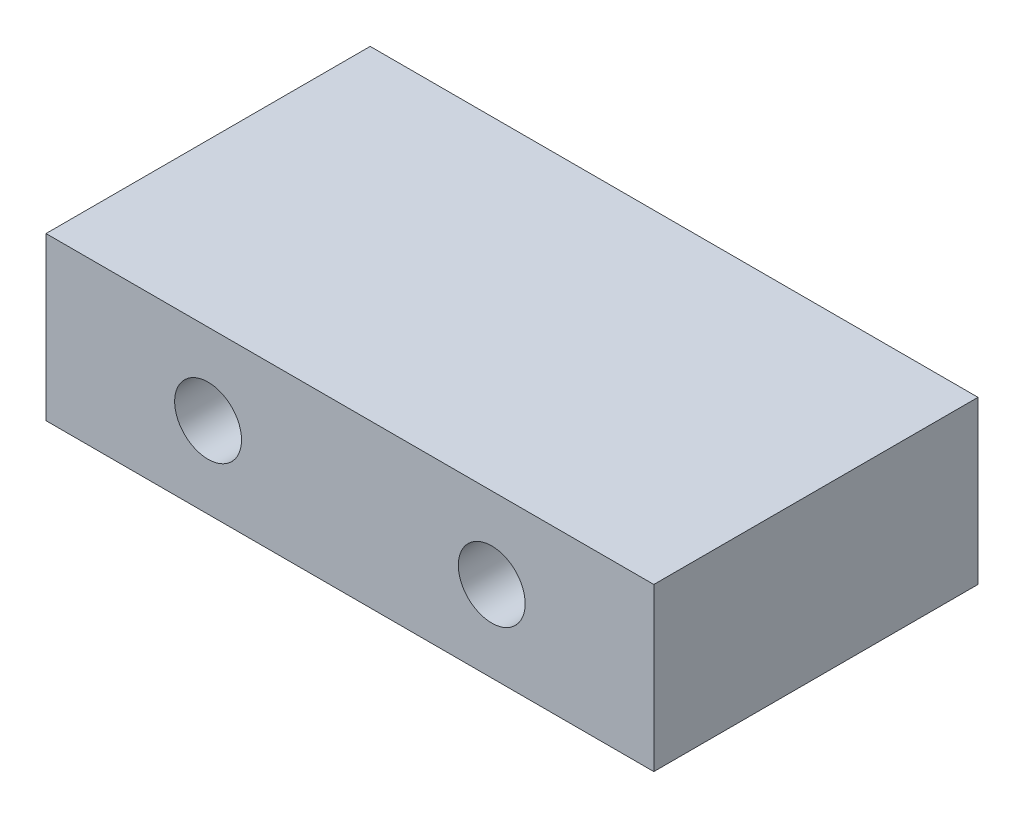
from build123d import *

# Parameters (mm, degrees)
SKETCH_1_W         = 30
SKETCH_1_H         = 8
EXTRUDE_1_DEPTH    = 16
HOLE_WIZARD_M4_1_D = 3.3


with BuildPart() as part:
    # Sketch 1 → Extrude 1 (new body)
    with BuildSketch(Plane.XY):
        Rectangle(SKETCH_1_W, SKETCH_1_H)
    extrude(amount=EXTRUDE_1_DEPTH)

    # Hole Wizard M4 _1 (through all)
    with Locations(Plane.XY.offset(16)):
        with Locations((-7, 0), (7, 0)):
            Hole(HOLE_WIZARD_M4_1_D / 2)


solid = part.part
